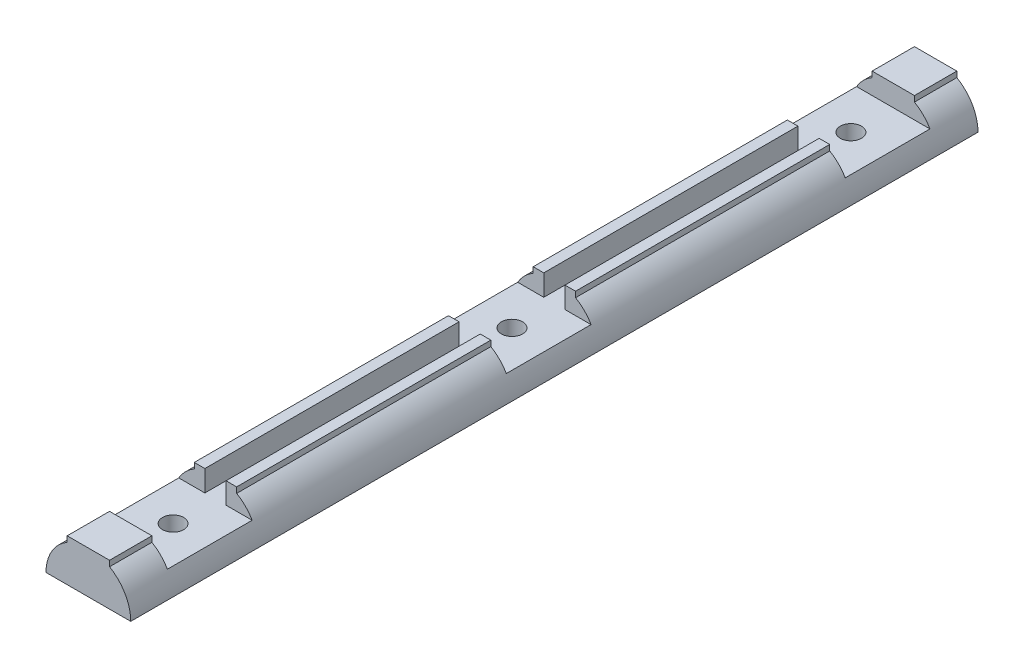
from build123d import *

# Parameters (mm, degrees)
SKETCH1_R           = 10
BOSS_EXTRUDE1_DEPTH = 100
SKETCH2_W           = 10
SKETCH2_H           = 20
BOSS_EXTRUDE2_DEPTH = 200
SKETCH3_W           = 17.320508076
SKETCH3_H           = 5
CUT_EXTRUDE1_DEPTH  = 10
SKETCH4_R           = 2.5
CUT_EXTRUDE3_DEPTH  = 102.612007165
SKETCH5_W           = 5
SKETCH5_H           = 140
CUT_EXTRUDE2_DEPTH  = 5
LPATTERN1_COUNT     = 3
LPATTERN1_PITCH     = 80
SKETCH6_W           = 20
SKETCH6_H           = 10
CUT_EXTRUDE4_DEPTH  = 201.499376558


with BuildPart() as part:
    # Sketch1 → Boss-Extrude1 (new, symmetric)
    with BuildSketch(Plane.XY):
        Circle(SKETCH1_R)
    extrude(amount=BOSS_EXTRUDE1_DEPTH, both=True)

    # Sketch2 → Boss-Extrude2 (add)
    with BuildSketch(Plane.XY.offset(100)):
        Rectangle(SKETCH2_W, SKETCH2_H)
    extrude(amount=-BOSS_EXTRUDE2_DEPTH)

    # Sketch3 → Cut-Extrude1 (cut, symmetric)
    with BuildSketch(Plane.XY.offset(-80)):
        with Locations((0, 7.5)):
            Rectangle(SKETCH3_W, SKETCH3_H)
    cut_extrude1 = extrude(amount=CUT_EXTRUDE1_DEPTH, both=True, mode=Mode.SUBTRACT)

    # Sketch4 → Cut-Extrude3 (cut, through all)
    with BuildSketch(Plane(origin=(0, 5, 0), x_dir=(1, 0, 0), z_dir=(0, 1, 0))):
        with Locations(Location((0, 80, 0), (0, 0, 270))):
            Circle(SKETCH4_R)
    cut_extrude3 = extrude(amount=-CUT_EXTRUDE3_DEPTH, mode=Mode.SUBTRACT)

    # Sketch5 → Cut-Extrude2 (cut)
    with BuildSketch(Plane(origin=(0, 10, 0), x_dir=(1, 0, 0), z_dir=(0, 1, 0))):
        Rectangle(SKETCH5_W, SKETCH5_H)
    extrude(amount=-CUT_EXTRUDE2_DEPTH, mode=Mode.SUBTRACT)

    # LPattern1: Cut-Extrude1, Cut-Extrude3 ×3
    with Locations(*[(0, 0, i * LPATTERN1_PITCH) for i in range(1, LPATTERN1_COUNT)]):
        add(cut_extrude1, mode=Mode.SUBTRACT)
        add(cut_extrude3, mode=Mode.SUBTRACT)

    # Sketch6 → Cut-Extrude4 (cut, through all)
    with BuildSketch(Plane.XY.offset(100)):
        with Locations((0, -5)):
            Rectangle(SKETCH6_W, SKETCH6_H)
    extrude(amount=-CUT_EXTRUDE4_DEPTH, mode=Mode.SUBTRACT)


solid = part.part
